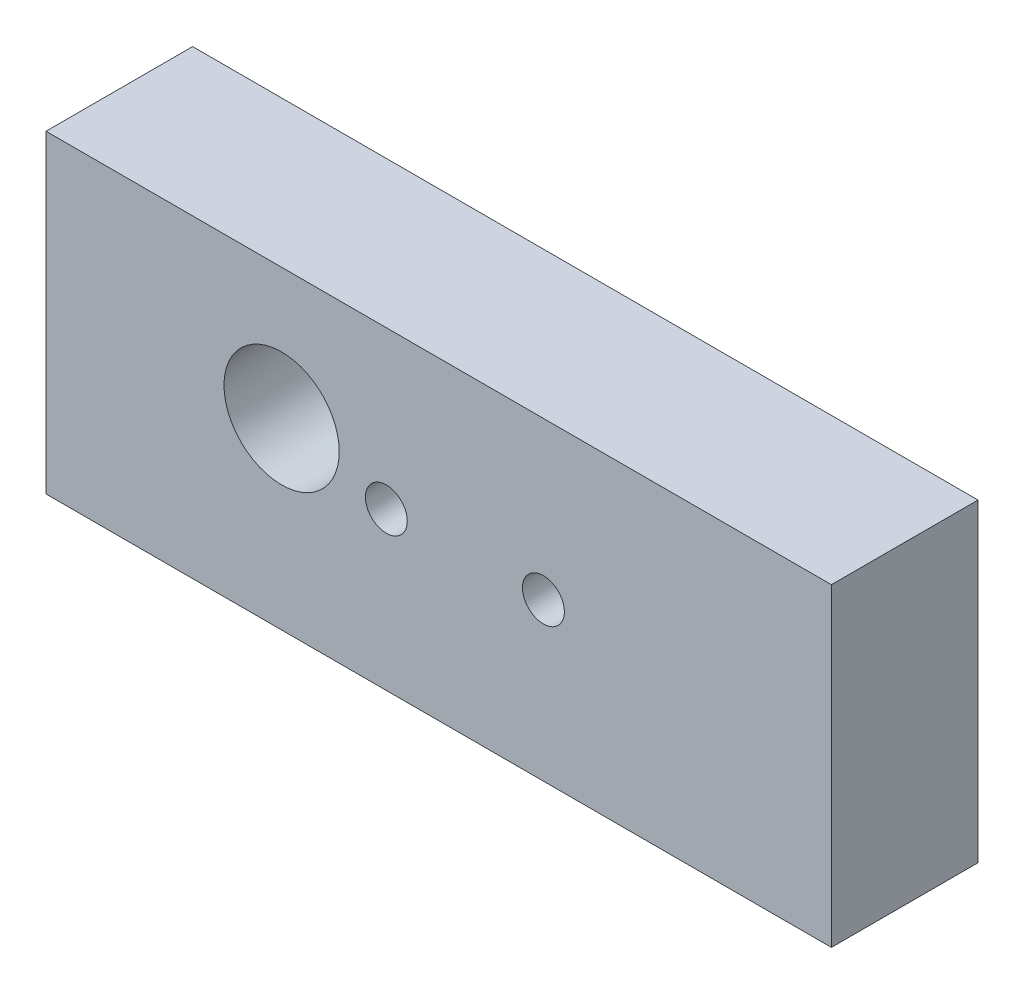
from build123d import *

# Parameters (mm, degrees)
SKETCH_1_W          = 150
SKETCH_1_H          = 60
EXTRUDE_1_DEPTH     = 28
SKETCH_2_R          = 11
CUT_EXTRUDE_1_DEPTH = 20
SKETCH_3_R          = 4
CUT_EXTRUDE_2_DEPTH = 20


with BuildPart() as part:
    # Sketch 1 → Extrude 1 (new body)
    with BuildSketch(Plane.XY):
        with Locations((75, 30)):
            Rectangle(SKETCH_1_W, SKETCH_1_H)
    extrude(amount=-EXTRUDE_1_DEPTH)

    # Sketch 2 → Cut-Extrude 1 (cut)
    with BuildSketch(Plane.XY):
        with Locations((45, 35)):
            Circle(SKETCH_2_R)
    extrude(amount=-CUT_EXTRUDE_1_DEPTH, mode=Mode.SUBTRACT)

    # Sketch 3 → Cut-Extrude 2 (cut)
    with BuildSketch(Plane.XY):
        with Locations((65, 30)):
            Circle(SKETCH_3_R)
        with Locations((95, 30)):
            Circle(SKETCH_3_R)
    extrude(amount=-CUT_EXTRUDE_2_DEPTH, mode=Mode.SUBTRACT)


solid = part.part
